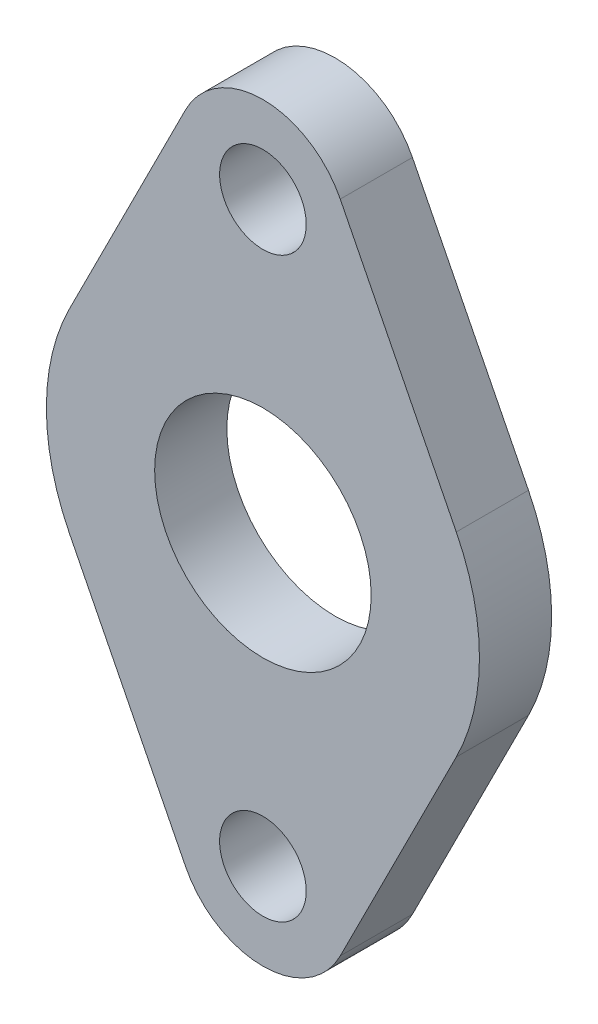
ISO-10303-21;
HEADER;
FILE_DESCRIPTION(('STEP AP214'),'2;1');
FILE_NAME('part.step','',(''),(''),'','','');
FILE_SCHEMA(('AUTOMOTIVE_DESIGN { 1 0 10303 214 1 1 1 1 }'));
ENDSEC;
DATA;
#1=APPLICATION_CONTEXT('core data for automotive mechanical design processes');
#2=APPLICATION_PROTOCOL_DEFINITION('international standard','automotive_design',2000,#1);
#3=PRODUCT_CONTEXT('',#1,'mechanical');
#4=PRODUCT('Part','Part','',(#3));
#5=PRODUCT_RELATED_PRODUCT_CATEGORY('part','',(#4));
#6=PRODUCT_DEFINITION_FORMATION('','',#4);
#7=PRODUCT_DEFINITION_CONTEXT('part definition',#1,'design');
#8=PRODUCT_DEFINITION('design','',#6,#7);
#9=PRODUCT_DEFINITION_SHAPE('','',#8);
#10=(LENGTH_UNIT() NAMED_UNIT(*) SI_UNIT(.MILLI.,.METRE.));
#11=(NAMED_UNIT(*) PLANE_ANGLE_UNIT() SI_UNIT($,.RADIAN.));
#12=(NAMED_UNIT(*) SI_UNIT($,.STERADIAN.) SOLID_ANGLE_UNIT());
#13=UNCERTAINTY_MEASURE_WITH_UNIT(LENGTH_MEASURE(1.E-05),#10,'distance_accuracy_value','');
#14=(GEOMETRIC_REPRESENTATION_CONTEXT(3) GLOBAL_UNCERTAINTY_ASSIGNED_CONTEXT((#13)) GLOBAL_UNIT_ASSIGNED_CONTEXT((#10,
#11,#12)) REPRESENTATION_CONTEXT('',''));
#15=CARTESIAN_POINT('',(0.,0.,0.));
#16=DIRECTION('',(0.,0.,1.));
#17=DIRECTION('',(1.,0.,0.));
#18=AXIS2_PLACEMENT_3D('',#15,#16,#17);
#19=CARTESIAN_POINT('',(0.,25.4,6.35));
#20=DIRECTION('',(0.,0.,1.));
#21=DIRECTION('',(1.,0.,0.));
#22=AXIS2_PLACEMENT_3D('',#19,#20,#21);
#23=PLANE('',#22);
#24=CARTESIAN_POINT('',(0.,25.4,6.35));
#25=DIRECTION('',(0.,0.,1.));
#26=DIRECTION('',(1.,0.,0.));
#27=AXIS2_PLACEMENT_3D('',#24,#25,#26);
#28=CIRCLE('',#27,3.81);
#29=CARTESIAN_POINT('',(3.81,25.4,6.35));
#30=VERTEX_POINT('',#29);
#31=EDGE_CURVE('E219',#30,#30,#28,.T.);
#32=ORIENTED_EDGE('',*,*,#31,.F.);
#33=EDGE_LOOP('',(#32));
#34=FACE_BOUND('',#33,.T.);
#35=CARTESIAN_POINT('',(0.,25.4,6.35));
#36=DIRECTION('',(0.,0.,1.));
#37=DIRECTION('',(1.,0.,0.));
#38=AXIS2_PLACEMENT_3D('',#35,#36,#37);
#39=CIRCLE('',#38,7.61999999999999);
#40=CARTESIAN_POINT('',(6.80487758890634,28.829,6.35));
#41=VERTEX_POINT('',#40);
#42=CARTESIAN_POINT('',(-6.80487758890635,28.829,6.35));
#43=VERTEX_POINT('',#42);
#44=EDGE_CURVE('E170',#41,#43,#39,.T.);
#45=ORIENTED_EDGE('',*,*,#44,.T.);
#46=DIRECTION('',(-0.45,-0.893028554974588,0.));
#47=VECTOR('',#46,1.);
#48=CARTESIAN_POINT('',(-6.80487758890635,28.829,6.35));
#49=LINE('',#48,#47);
#50=CARTESIAN_POINT('',(-17.0121939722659,8.5725,6.35));
#51=VERTEX_POINT('',#50);
#52=EDGE_CURVE('E106',#43,#51,#49,.T.);
#53=ORIENTED_EDGE('',*,*,#52,.T.);
#54=CARTESIAN_POINT('',(0.,0.,6.35));
#55=DIRECTION('',(0.,0.,1.));
#56=DIRECTION('',(1.,0.,0.));
#57=AXIS2_PLACEMENT_3D('',#54,#55,#56);
#58=CIRCLE('',#57,19.05);
#59=CARTESIAN_POINT('',(-17.0121939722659,-8.5725,6.35));
#60=VERTEX_POINT('',#59);
#61=EDGE_CURVE('E191',#51,#60,#58,.T.);
#62=ORIENTED_EDGE('',*,*,#61,.T.);
#63=DIRECTION('',(0.45,-0.893028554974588,0.));
#64=VECTOR('',#63,1.);
#65=CARTESIAN_POINT('',(-17.0121939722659,-8.5725,6.35));
#66=LINE('',#65,#64);
#67=CARTESIAN_POINT('',(-6.80487758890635,-28.829,6.35));
#68=VERTEX_POINT('',#67);
#69=EDGE_CURVE('E205',#60,#68,#66,.T.);
#70=ORIENTED_EDGE('',*,*,#69,.T.);
#71=CARTESIAN_POINT('',(0.,-25.4,6.35));
#72=DIRECTION('',(0.,0.,1.));
#73=DIRECTION('',(1.,0.,0.));
#74=AXIS2_PLACEMENT_3D('',#71,#72,#73);
#75=CIRCLE('',#74,7.61999999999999);
#76=CARTESIAN_POINT('',(6.80487758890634,-28.829,6.35));
#77=VERTEX_POINT('',#76);
#78=EDGE_CURVE('E125',#68,#77,#75,.T.);
#79=ORIENTED_EDGE('',*,*,#78,.T.);
#80=DIRECTION('',(0.450000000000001,0.893028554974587,0.));
#81=VECTOR('',#80,1.);
#82=CARTESIAN_POINT('',(6.80487758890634,-28.829,6.35));
#83=LINE('',#82,#81);
#84=CARTESIAN_POINT('',(17.0121939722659,-8.57250000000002,6.35));
#85=VERTEX_POINT('',#84);
#86=EDGE_CURVE('E119',#77,#85,#83,.T.);
#87=ORIENTED_EDGE('',*,*,#86,.T.);
#88=CARTESIAN_POINT('',(0.,0.,6.35));
#89=DIRECTION('',(0.,0.,1.));
#90=DIRECTION('',(1.,0.,0.));
#91=AXIS2_PLACEMENT_3D('',#88,#89,#90);
#92=CIRCLE('',#91,19.05);
#93=CARTESIAN_POINT('',(17.0121939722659,8.57250000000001,6.35));
#94=VERTEX_POINT('',#93);
#95=EDGE_CURVE('E123',#85,#94,#92,.T.);
#96=ORIENTED_EDGE('',*,*,#95,.T.);
#97=DIRECTION('',(-0.450000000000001,0.893028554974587,0.));
#98=VECTOR('',#97,1.);
#99=CARTESIAN_POINT('',(6.80487758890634,28.829,6.35));
#100=LINE('',#99,#98);
#101=EDGE_CURVE('E63',#94,#41,#100,.T.);
#102=ORIENTED_EDGE('',*,*,#101,.T.);
#103=EDGE_LOOP('',(#45,#53,#62,#70,#79,#87,#96,#102));
#104=FACE_BOUND('',#103,.T.);
#105=CARTESIAN_POINT('',(0.,0.,6.35));
#106=DIRECTION('',(0.,0.,1.));
#107=DIRECTION('',(1.,0.,0.));
#108=AXIS2_PLACEMENT_3D('',#105,#106,#107);
#109=CIRCLE('',#108,9.525);
#110=CARTESIAN_POINT('',(9.525,0.,6.35));
#111=VERTEX_POINT('',#110);
#112=EDGE_CURVE('E152',#111,#111,#109,.T.);
#113=ORIENTED_EDGE('',*,*,#112,.F.);
#114=EDGE_LOOP('',(#113));
#115=FACE_BOUND('',#114,.T.);
#116=CARTESIAN_POINT('',(0.,-25.4,6.35));
#117=DIRECTION('',(0.,0.,1.));
#118=DIRECTION('',(1.,0.,0.));
#119=AXIS2_PLACEMENT_3D('',#116,#117,#118);
#120=CIRCLE('',#119,3.81);
#121=CARTESIAN_POINT('',(3.81,-25.4,6.35));
#122=VERTEX_POINT('',#121);
#123=EDGE_CURVE('E227',#122,#122,#120,.T.);
#124=ORIENTED_EDGE('',*,*,#123,.F.);
#125=EDGE_LOOP('',(#124));
#126=FACE_BOUND('',#125,.T.);
#127=ADVANCED_FACE('F45',(#34,#104,#115,#126),#23,.T.);
#128=CARTESIAN_POINT('',(0.,25.4,0.));
#129=DIRECTION('',(0.,0.,1.));
#130=DIRECTION('',(1.,0.,0.));
#131=AXIS2_PLACEMENT_3D('',#128,#129,#130);
#132=PLANE('',#131);
#133=CARTESIAN_POINT('',(0.,25.4,0.));
#134=DIRECTION('',(0.,0.,1.));
#135=DIRECTION('',(1.,0.,0.));
#136=AXIS2_PLACEMENT_3D('',#133,#134,#135);
#137=CIRCLE('',#136,7.61999999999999);
#138=CARTESIAN_POINT('',(6.80487758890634,28.829,0.));
#139=VERTEX_POINT('',#138);
#140=CARTESIAN_POINT('',(-6.80487758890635,28.829,0.));
#141=VERTEX_POINT('',#140);
#142=EDGE_CURVE('E147',#139,#141,#137,.T.);
#143=ORIENTED_EDGE('',*,*,#142,.F.);
#144=DIRECTION('',(-0.450000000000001,0.893028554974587,0.));
#145=VECTOR('',#144,1.);
#146=CARTESIAN_POINT('',(6.80487758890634,28.829,0.));
#147=LINE('',#146,#145);
#148=CARTESIAN_POINT('',(17.0121939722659,8.57250000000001,0.));
#149=VERTEX_POINT('',#148);
#150=EDGE_CURVE('E98',#149,#139,#147,.T.);
#151=ORIENTED_EDGE('',*,*,#150,.F.);
#152=CARTESIAN_POINT('',(0.,0.,0.));
#153=DIRECTION('',(0.,0.,1.));
#154=DIRECTION('',(1.,0.,0.));
#155=AXIS2_PLACEMENT_3D('',#152,#153,#154);
#156=CIRCLE('',#155,19.05);
#157=CARTESIAN_POINT('',(17.0121939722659,-8.57250000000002,0.));
#158=VERTEX_POINT('',#157);
#159=EDGE_CURVE('E92',#158,#149,#156,.T.);
#160=ORIENTED_EDGE('',*,*,#159,.F.);
#161=DIRECTION('',(0.450000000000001,0.893028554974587,0.));
#162=VECTOR('',#161,1.);
#163=CARTESIAN_POINT('',(6.80487758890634,-28.829,0.));
#164=LINE('',#163,#162);
#165=CARTESIAN_POINT('',(6.80487758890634,-28.829,0.));
#166=VERTEX_POINT('',#165);
#167=EDGE_CURVE('E134',#166,#158,#164,.T.);
#168=ORIENTED_EDGE('',*,*,#167,.F.);
#169=CARTESIAN_POINT('',(0.,-25.4,0.));
#170=DIRECTION('',(0.,0.,1.));
#171=DIRECTION('',(1.,0.,0.));
#172=AXIS2_PLACEMENT_3D('',#169,#170,#171);
#173=CIRCLE('',#172,7.61999999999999);
#174=CARTESIAN_POINT('',(-6.80487758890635,-28.829,0.));
#175=VERTEX_POINT('',#174);
#176=EDGE_CURVE('E161',#175,#166,#173,.T.);
#177=ORIENTED_EDGE('',*,*,#176,.F.);
#178=DIRECTION('',(0.45,-0.893028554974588,0.));
#179=VECTOR('',#178,1.);
#180=CARTESIAN_POINT('',(-17.0121939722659,-8.5725,0.));
#181=LINE('',#180,#179);
#182=CARTESIAN_POINT('',(-17.0121939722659,-8.5725,0.));
#183=VERTEX_POINT('',#182);
#184=EDGE_CURVE('E158',#183,#175,#181,.T.);
#185=ORIENTED_EDGE('',*,*,#184,.F.);
#186=CARTESIAN_POINT('',(0.,0.,0.));
#187=DIRECTION('',(0.,0.,1.));
#188=DIRECTION('',(1.,0.,0.));
#189=AXIS2_PLACEMENT_3D('',#186,#187,#188);
#190=CIRCLE('',#189,19.05);
#191=CARTESIAN_POINT('',(-17.0121939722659,8.5725,0.));
#192=VERTEX_POINT('',#191);
#193=EDGE_CURVE('E155',#192,#183,#190,.T.);
#194=ORIENTED_EDGE('',*,*,#193,.F.);
#195=DIRECTION('',(-0.45,-0.893028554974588,0.));
#196=VECTOR('',#195,1.);
#197=CARTESIAN_POINT('',(-6.80487758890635,28.829,0.));
#198=LINE('',#197,#196);
#199=EDGE_CURVE('E151',#141,#192,#198,.T.);
#200=ORIENTED_EDGE('',*,*,#199,.F.);
#201=EDGE_LOOP('',(#143,#151,#160,#168,#177,#185,#194,#200));
#202=FACE_BOUND('',#201,.T.);
#203=CARTESIAN_POINT('',(0.,0.,0.));
#204=DIRECTION('',(0.,0.,1.));
#205=DIRECTION('',(1.,0.,0.));
#206=AXIS2_PLACEMENT_3D('',#203,#204,#205);
#207=CIRCLE('',#206,9.525);
#208=CARTESIAN_POINT('',(9.525,0.,0.));
#209=VERTEX_POINT('',#208);
#210=EDGE_CURVE('E215',#209,#209,#207,.T.);
#211=ORIENTED_EDGE('',*,*,#210,.T.);
#212=EDGE_LOOP('',(#211));
#213=FACE_BOUND('',#212,.T.);
#214=CARTESIAN_POINT('',(0.,25.4,0.));
#215=DIRECTION('',(0.,0.,1.));
#216=DIRECTION('',(1.,0.,0.));
#217=AXIS2_PLACEMENT_3D('',#214,#215,#216);
#218=CIRCLE('',#217,3.81);
#219=CARTESIAN_POINT('',(3.81,25.4,0.));
#220=VERTEX_POINT('',#219);
#221=EDGE_CURVE('E223',#220,#220,#218,.T.);
#222=ORIENTED_EDGE('',*,*,#221,.T.);
#223=EDGE_LOOP('',(#222));
#224=FACE_BOUND('',#223,.T.);
#225=CARTESIAN_POINT('',(0.,-25.4,0.));
#226=DIRECTION('',(0.,0.,1.));
#227=DIRECTION('',(1.,0.,0.));
#228=AXIS2_PLACEMENT_3D('',#225,#226,#227);
#229=CIRCLE('',#228,3.81);
#230=CARTESIAN_POINT('',(3.81,-25.4,0.));
#231=VERTEX_POINT('',#230);
#232=EDGE_CURVE('E231',#231,#231,#229,.T.);
#233=ORIENTED_EDGE('',*,*,#232,.T.);
#234=EDGE_LOOP('',(#233));
#235=FACE_BOUND('',#234,.T.);
#236=ADVANCED_FACE('F195',(#202,#213,#224,#235),#132,.F.);
#237=CARTESIAN_POINT('',(0.,25.4,6.35));
#238=DIRECTION('',(0.,0.,-1.));
#239=DIRECTION('',(-1.,0.,0.));
#240=AXIS2_PLACEMENT_3D('',#237,#238,#239);
#241=CYLINDRICAL_SURFACE('',#240,7.61999999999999);
#242=ORIENTED_EDGE('',*,*,#142,.T.);
#243=DIRECTION('',(0.,0.,-1.));
#244=VECTOR('',#243,1.);
#245=CARTESIAN_POINT('',(-6.80487758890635,28.829,6.35));
#246=LINE('',#245,#244);
#247=EDGE_CURVE('E11',#43,#141,#246,.T.);
#248=ORIENTED_EDGE('',*,*,#247,.F.);
#249=ORIENTED_EDGE('',*,*,#44,.F.);
#250=DIRECTION('',(0.,0.,-1.));
#251=VECTOR('',#250,1.);
#252=CARTESIAN_POINT('',(6.80487758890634,28.829,6.35));
#253=LINE('',#252,#251);
#254=EDGE_CURVE('E143',#41,#139,#253,.T.);
#255=ORIENTED_EDGE('',*,*,#254,.T.);
#256=EDGE_LOOP('',(#242,#248,#249,#255));
#257=FACE_BOUND('',#256,.T.);
#258=ADVANCED_FACE('F47',(#257),#241,.T.);
#259=CARTESIAN_POINT('',(-6.80487758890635,28.829,6.35));
#260=DIRECTION('',(0.893028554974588,-0.45,0.));
#261=DIRECTION('',(0.45,0.893028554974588,0.));
#262=AXIS2_PLACEMENT_3D('',#259,#260,#261);
#263=PLANE('',#262);
#264=ORIENTED_EDGE('',*,*,#199,.T.);
#265=DIRECTION('',(0.,0.,-1.));
#266=VECTOR('',#265,1.);
#267=CARTESIAN_POINT('',(-17.0121939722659,8.5725,6.35));
#268=LINE('',#267,#266);
#269=EDGE_CURVE('E55',#51,#192,#268,.T.);
#270=ORIENTED_EDGE('',*,*,#269,.F.);
#271=ORIENTED_EDGE('',*,*,#52,.F.);
#272=ORIENTED_EDGE('',*,*,#247,.T.);
#273=EDGE_LOOP('',(#264,#270,#271,#272));
#274=FACE_BOUND('',#273,.T.);
#275=ADVANCED_FACE('F266',(#274),#263,.F.);
#276=CARTESIAN_POINT('',(0.,0.,6.35));
#277=DIRECTION('',(0.,0.,-1.));
#278=DIRECTION('',(-1.,0.,0.));
#279=AXIS2_PLACEMENT_3D('',#276,#277,#278);
#280=CYLINDRICAL_SURFACE('',#279,19.05);
#281=ORIENTED_EDGE('',*,*,#193,.T.);
#282=DIRECTION('',(0.,0.,-1.));
#283=VECTOR('',#282,1.);
#284=CARTESIAN_POINT('',(-17.0121939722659,-8.5725,6.35));
#285=LINE('',#284,#283);
#286=EDGE_CURVE('E181',#60,#183,#285,.T.);
#287=ORIENTED_EDGE('',*,*,#286,.F.);
#288=ORIENTED_EDGE('',*,*,#61,.F.);
#289=ORIENTED_EDGE('',*,*,#269,.T.);
#290=EDGE_LOOP('',(#281,#287,#288,#289));
#291=FACE_BOUND('',#290,.T.);
#292=ADVANCED_FACE('F189',(#291),#280,.T.);
#293=CARTESIAN_POINT('',(-17.0121939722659,-8.5725,6.35));
#294=DIRECTION('',(0.893028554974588,0.45,0.));
#295=DIRECTION('',(-0.45,0.893028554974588,0.));
#296=AXIS2_PLACEMENT_3D('',#293,#294,#295);
#297=PLANE('',#296);
#298=ORIENTED_EDGE('',*,*,#184,.T.);
#299=DIRECTION('',(0.,0.,-1.));
#300=VECTOR('',#299,1.);
#301=CARTESIAN_POINT('',(-6.80487758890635,-28.829,6.35));
#302=LINE('',#301,#300);
#303=EDGE_CURVE('E177',#68,#175,#302,.T.);
#304=ORIENTED_EDGE('',*,*,#303,.F.);
#305=ORIENTED_EDGE('',*,*,#69,.F.);
#306=ORIENTED_EDGE('',*,*,#286,.T.);
#307=EDGE_LOOP('',(#298,#304,#305,#306));
#308=FACE_BOUND('',#307,.T.);
#309=ADVANCED_FACE('F200',(#308),#297,.F.);
#310=CARTESIAN_POINT('',(0.,-25.4,6.35));
#311=DIRECTION('',(0.,0.,-1.));
#312=DIRECTION('',(-1.,0.,0.));
#313=AXIS2_PLACEMENT_3D('',#310,#311,#312);
#314=CYLINDRICAL_SURFACE('',#313,7.61999999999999);
#315=ORIENTED_EDGE('',*,*,#176,.T.);
#316=DIRECTION('',(0.,0.,-1.));
#317=VECTOR('',#316,1.);
#318=CARTESIAN_POINT('',(6.80487758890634,-28.829,6.35));
#319=LINE('',#318,#317);
#320=EDGE_CURVE('E136',#77,#166,#319,.T.);
#321=ORIENTED_EDGE('',*,*,#320,.F.);
#322=ORIENTED_EDGE('',*,*,#78,.F.);
#323=ORIENTED_EDGE('',*,*,#303,.T.);
#324=EDGE_LOOP('',(#315,#321,#322,#323));
#325=FACE_BOUND('',#324,.T.);
#326=ADVANCED_FACE('F203',(#325),#314,.T.);
#327=CARTESIAN_POINT('',(6.80487758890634,-28.829,6.35));
#328=DIRECTION('',(-0.893028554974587,0.450000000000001,0.));
#329=DIRECTION('',(-0.450000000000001,-0.893028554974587,0.));
#330=AXIS2_PLACEMENT_3D('',#327,#328,#329);
#331=PLANE('',#330);
#332=ORIENTED_EDGE('',*,*,#167,.T.);
#333=DIRECTION('',(0.,0.,-1.));
#334=VECTOR('',#333,1.);
#335=CARTESIAN_POINT('',(17.0121939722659,-8.57250000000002,6.35));
#336=LINE('',#335,#334);
#337=EDGE_CURVE('E131',#85,#158,#336,.T.);
#338=ORIENTED_EDGE('',*,*,#337,.F.);
#339=ORIENTED_EDGE('',*,*,#86,.F.);
#340=ORIENTED_EDGE('',*,*,#320,.T.);
#341=EDGE_LOOP('',(#332,#338,#339,#340));
#342=FACE_BOUND('',#341,.T.);
#343=ADVANCED_FACE('F132',(#342),#331,.F.);
#344=CARTESIAN_POINT('',(0.,0.,6.35));
#345=DIRECTION('',(0.,0.,-1.));
#346=DIRECTION('',(-1.,0.,0.));
#347=AXIS2_PLACEMENT_3D('',#344,#345,#346);
#348=CYLINDRICAL_SURFACE('',#347,19.05);
#349=ORIENTED_EDGE('',*,*,#159,.T.);
#350=DIRECTION('',(0.,0.,-1.));
#351=VECTOR('',#350,1.);
#352=CARTESIAN_POINT('',(17.0121939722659,8.57250000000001,6.35));
#353=LINE('',#352,#351);
#354=EDGE_CURVE('E137',#94,#149,#353,.T.);
#355=ORIENTED_EDGE('',*,*,#354,.F.);
#356=ORIENTED_EDGE('',*,*,#95,.F.);
#357=ORIENTED_EDGE('',*,*,#337,.T.);
#358=EDGE_LOOP('',(#349,#355,#356,#357));
#359=FACE_BOUND('',#358,.T.);
#360=ADVANCED_FACE('F139',(#359),#348,.T.);
#361=CARTESIAN_POINT('',(6.80487758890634,28.829,6.35));
#362=DIRECTION('',(-0.893028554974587,-0.450000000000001,0.));
#363=DIRECTION('',(0.450000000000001,-0.893028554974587,0.));
#364=AXIS2_PLACEMENT_3D('',#361,#362,#363);
#365=PLANE('',#364);
#366=ORIENTED_EDGE('',*,*,#150,.T.);
#367=ORIENTED_EDGE('',*,*,#254,.F.);
#368=ORIENTED_EDGE('',*,*,#101,.F.);
#369=ORIENTED_EDGE('',*,*,#354,.T.);
#370=EDGE_LOOP('',(#366,#367,#368,#369));
#371=FACE_BOUND('',#370,.T.);
#372=ADVANCED_FACE('F254',(#371),#365,.F.);
#373=CARTESIAN_POINT('',(0.,0.,6.35));
#374=DIRECTION('',(0.,0.,-1.));
#375=DIRECTION('',(-1.,0.,0.));
#376=AXIS2_PLACEMENT_3D('',#373,#374,#375);
#377=CYLINDRICAL_SURFACE('',#376,9.525);
#378=ORIENTED_EDGE('',*,*,#112,.T.);
#379=EDGE_LOOP('',(#378));
#380=FACE_BOUND('',#379,.T.);
#381=ORIENTED_EDGE('',*,*,#210,.F.);
#382=EDGE_LOOP('',(#381));
#383=FACE_BOUND('',#382,.T.);
#384=ADVANCED_FACE('F251',(#380,#383),#377,.F.);
#385=CARTESIAN_POINT('',(0.,25.4,6.35));
#386=DIRECTION('',(0.,0.,-1.));
#387=DIRECTION('',(-1.,0.,0.));
#388=AXIS2_PLACEMENT_3D('',#385,#386,#387);
#389=CYLINDRICAL_SURFACE('',#388,3.81);
#390=ORIENTED_EDGE('',*,*,#31,.T.);
#391=EDGE_LOOP('',(#390));
#392=FACE_BOUND('',#391,.T.);
#393=ORIENTED_EDGE('',*,*,#221,.F.);
#394=EDGE_LOOP('',(#393));
#395=FACE_BOUND('',#394,.T.);
#396=ADVANCED_FACE('F315',(#392,#395),#389,.F.);
#397=CARTESIAN_POINT('',(0.,-25.4,6.35));
#398=DIRECTION('',(0.,0.,-1.));
#399=DIRECTION('',(-1.,0.,0.));
#400=AXIS2_PLACEMENT_3D('',#397,#398,#399);
#401=CYLINDRICAL_SURFACE('',#400,3.81);
#402=ORIENTED_EDGE('',*,*,#123,.T.);
#403=EDGE_LOOP('',(#402));
#404=FACE_BOUND('',#403,.T.);
#405=ORIENTED_EDGE('',*,*,#232,.F.);
#406=EDGE_LOOP('',(#405));
#407=FACE_BOUND('',#406,.T.);
#408=ADVANCED_FACE('F239',(#404,#407),#401,.F.);
#409=CLOSED_SHELL('',(#127,#236,#258,#275,#292,#309,#326,#343,#360,#372,#384,#396,#408));
#410=MANIFOLD_SOLID_BREP('B2',#409);
#411=ADVANCED_BREP_SHAPE_REPRESENTATION('',(#18,#410),#14);
#412=SHAPE_DEFINITION_REPRESENTATION(#9,#411);
ENDSEC;
END-ISO-10303-21;
